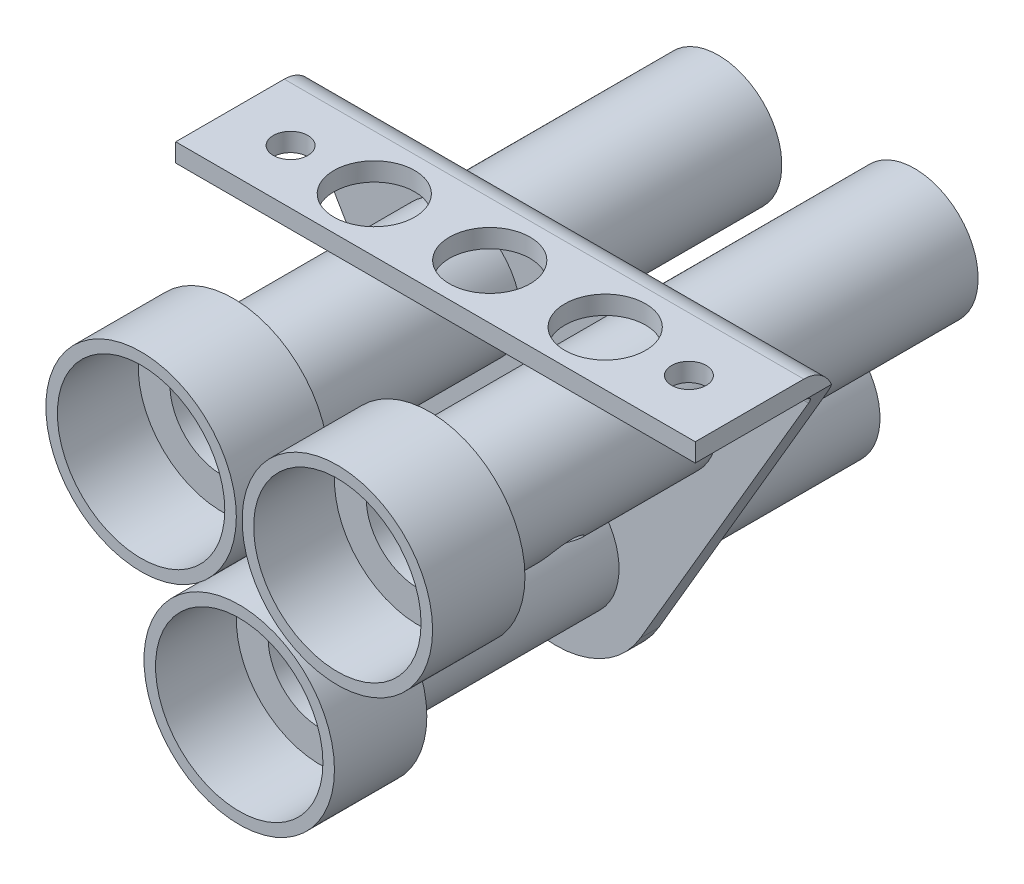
from build123d import *

# Parameters (mm, degrees)
ESQUISSE1_R             = 5.5
ESQUISSE1_R_2           = 4.5
BOSS_EXTRU_1_DEPTH      = 42
BOSS_EXTRU_1_2_DEPTH    = 42
BOSS_EXTRU_1_3_DEPTH    = 42
ESQUISSE2_R             = 8.25
ESQUISSE2_R_2           = 4.5
BOSS_EXTRU_2_DEPTH      = 1
ESQUISSE3_R             = 8.25
ESQUISSE3_R_2           = 7.25
BOSS_EXTRU_3_DEPTH      = 7
ESQUISSE4_R             = 2
ESQUISSE4_R_2           = 5.5
BOSS_EXTRU_4_DEPTH      = 1.6
ESQUISSE5_W             = 45
ESQUISSE5_H             = 12
BOSS_EXTRU_5_DEPTH      = 1.6
CONG_1_R                = 1
CONG_2_R                = 2.6
ENL_V_MAT_EXTRU_1_REACH = 65.345
ESQUISSE6_R             = 1.5
ESQUISSE6_R_2           = 3.5
ESQUISSE7_R             = 2
ENL_V_MAT_EXTRU_2_DEPTH = 63.612632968
ESQUISSE8_R             = 2
ENL_V_MAT_EXTRU_3_DEPTH = 63.612632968


with BuildPart() as part:
    # Esquisse1 → Boss.-Extru.1 (new body)
    with BuildSketch(Plane.XY):
        with Locations(Location((-8.5, -8.5, 0), (0, 0, 180))):
            Circle(ESQUISSE1_R)
        with Locations(Location((-8.5, -8.5, 0), (0, 0, 180))):
            Circle(ESQUISSE1_R_2, mode=Mode.SUBTRACT)
    extrude(amount=BOSS_EXTRU_1_DEPTH)



with BuildPart() as body_2:
    # Esquisse1 → Boss.-Extru.1 2 (new body)
    with BuildSketch(Plane.XY):
        with Locations(Location((8.5, -8.5, 0), (0, 0, 180))):
            Circle(ESQUISSE1_R)
        with Locations(Location((8.5, -8.5, 0), (0, 0, 180))):
            Circle(ESQUISSE1_R_2, mode=Mode.SUBTRACT)
    extrude(amount=BOSS_EXTRU_1_2_DEPTH)


with BuildPart() as body_3:
    # Esquisse1 → Boss.-Extru.1 3 (new body)
    with BuildSketch(Plane.XY):
        with Locations(Location((0, -23.222431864, 0), (0, 0, 180))):
            Circle(ESQUISSE1_R)
        with Locations(Location((0, -23.222431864, 0), (0, 0, 180))):
            Circle(ESQUISSE1_R_2, mode=Mode.SUBTRACT)
    extrude(amount=BOSS_EXTRU_1_3_DEPTH)


with BuildPart() as part_1:
    add(part.part)

    add(body_2.part)  # Boss.-Extru.2 merges body 2

    add(body_3.part)  # Boss.-Extru.2 merges body 3
    # Esquisse2 → Boss.-Extru.2 (add)
    # profile 1 of 3: a face of its own
    with BuildSketch(Plane.XY.offset(42)):
        with Locations((-8.5, -8.5)):
            Circle(ESQUISSE2_R)
        with Locations(Location((-8.5, -8.5, 0), (0, 0, 180))):
            Circle(ESQUISSE2_R_2, mode=Mode.SUBTRACT)
    # profile 2 of 3: a face of its own
    with BuildSketch(Plane.XY.offset(42)):
        with Locations((8.5, -8.5)):
            Circle(ESQUISSE2_R)
        with Locations(Location((8.5, -8.5, 0), (0, 0, 180))):
            Circle(ESQUISSE2_R_2, mode=Mode.SUBTRACT)
    # profile 3 of 3: a face of its own
    with BuildSketch(Plane.XY.offset(42)):
        with Locations((0, -23.222431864)):
            Circle(ESQUISSE2_R)
        with Locations(Location((0, -23.222431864, 0), (0, 0, 180))):
            Circle(ESQUISSE2_R_2, mode=Mode.SUBTRACT)
    extrude(amount=BOSS_EXTRU_2_DEPTH)

    # Esquisse3 → Boss.-Extru.3 (add)
    # profile 1 of 3: a face of its own
    with BuildSketch(Plane.XY.offset(43)):
        with Locations((-8.5, -8.5)):
            Circle(ESQUISSE3_R)
        with Locations((-8.5, -8.5)):
            Circle(ESQUISSE3_R_2, mode=Mode.SUBTRACT)
    # profile 2 of 3: a face of its own
    with BuildSketch(Plane.XY.offset(43)):
        with Locations((8.5, -8.5)):
            Circle(ESQUISSE3_R)
        with Locations((8.5, -8.5)):
            Circle(ESQUISSE3_R_2, mode=Mode.SUBTRACT)
    # profile 3 of 3: a face of its own
    with BuildSketch(Plane.XY.offset(43)):
        with Locations((0, -23.222431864)):
            Circle(ESQUISSE3_R)
        with Locations((0, -23.222431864)):
            Circle(ESQUISSE3_R_2, mode=Mode.SUBTRACT)
    extrude(amount=BOSS_EXTRU_3_DEPTH)

    # Esquisse4 → Boss.-Extru.4 (add)
    with BuildSketch(Plane(origin=(0, 0, 21), x_dir=(-1, 0, 0), z_dir=(0, 0, -1))):
        with BuildLine():
            Line((-22.5, 0), (22.5, 0))
            Line((22.5, 0), (22.5, -1.6))
            Line((22.5, -1.6), (7.336391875, -27.515141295))
            ThreePointArc((7.336391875, -27.515141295), (0, -31.722431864), (-7.336391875, -27.515141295))
            Line((-7.336391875, -27.515141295), (-22.5, -1.6))
            Line((-22.5, -1.6), (-22.5, 0))
        make_face()
        with Locations((0, -13.407477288)):
            Circle(ESQUISSE4_R, mode=Mode.SUBTRACT)
        with Locations((0, -23.222431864)):
            Circle(ESQUISSE4_R_2, mode=Mode.SUBTRACT)
        with Locations((8.5, -8.5)):
            Circle(ESQUISSE4_R_2, mode=Mode.SUBTRACT)
        with Locations((-8.5, -8.5)):
            Circle(ESQUISSE4_R_2, mode=Mode.SUBTRACT)
    extrude(amount=-BOSS_EXTRU_4_DEPTH)

    # Esquisse5 → Boss.-Extru.5 (add)
    with BuildSketch(Plane(origin=(0, 0, 0), x_dir=(1, 0, 0), z_dir=(0, 1, 0))):
        with Locations((0, -27)):
            Rectangle(ESQUISSE5_W, ESQUISSE5_H)
    extrude(amount=-BOSS_EXTRU_5_DEPTH)

    # Cong_1
    cong_1_edges = [part_1.edges().sort_by_distance(p)[0] for p in [
        (0, -1.6, 22.6),
    ]]
    fillet(cong_1_edges, radius=CONG_1_R)

    # Cong_2
    cong_2_edges = [part_1.edges().sort_by_distance(p)[0] for p in [
        (0, 0, 21),
    ]]
    fillet(cong_2_edges, radius=CONG_2_R)

    # Esquisse6 → Enl_v. mat.-Extru.1 (cut, up to next)
    with BuildSketch(Plane(origin=(0, 0, 0), x_dir=(1, 0, 0), z_dir=(0, 1, 0)), mode=Mode.PRIVATE) as enl_v_mat_extru_1_sk1:
        with Locations(Location((-17.25, -28.3, 0), (0, 0, 180))):
            Circle(ESQUISSE6_R)
    enl_v_mat_extru_1_tool1 = extrude(enl_v_mat_extru_1_sk1.sketch, amount=-ENL_V_MAT_EXTRU_1_REACH, mode=Mode.PRIVATE) & part_1.part
    # Esquisse6 → Enl_v. mat.-Extru.1 (cut, up to next)
    with BuildSketch(Plane(origin=(0, 0, 0), x_dir=(1, 0, 0), z_dir=(0, 1, 0)), mode=Mode.PRIVATE) as enl_v_mat_extru_1_sk2:
        with Locations(Location((17.25, -28.3, 0), (0, 0, 180))):
            Circle(ESQUISSE6_R)
    enl_v_mat_extru_1_tool2 = extrude(enl_v_mat_extru_1_sk2.sketch, amount=-ENL_V_MAT_EXTRU_1_REACH, mode=Mode.PRIVATE) & part_1.part
    # Esquisse6 → Enl_v. mat.-Extru.1 (cut, up to next)
    with BuildSketch(Plane(origin=(0, 0, 0), x_dir=(1, 0, 0), z_dir=(0, 1, 0)), mode=Mode.PRIVATE) as enl_v_mat_extru_1_sk3:
        with Locations(Location((10, -28.3, 0), (0, 0, 180))):
            Circle(ESQUISSE6_R_2)
    enl_v_mat_extru_1_tool3 = extrude(enl_v_mat_extru_1_sk3.sketch, amount=-ENL_V_MAT_EXTRU_1_REACH, mode=Mode.PRIVATE) & part_1.part
    # Esquisse6 → Enl_v. mat.-Extru.1 (cut, up to next)
    with BuildSketch(Plane(origin=(0, 0, 0), x_dir=(1, 0, 0), z_dir=(0, 1, 0)), mode=Mode.PRIVATE) as enl_v_mat_extru_1_sk4:
        with Locations(Location((0, -28.3, 0), (0, 0, 180))):
            Circle(ESQUISSE6_R_2)
    enl_v_mat_extru_1_tool4 = extrude(enl_v_mat_extru_1_sk4.sketch, amount=-ENL_V_MAT_EXTRU_1_REACH, mode=Mode.PRIVATE) & part_1.part
    # Esquisse6 → Enl_v. mat.-Extru.1 (cut, up to next)
    with BuildSketch(Plane(origin=(0, 0, 0), x_dir=(1, 0, 0), z_dir=(0, 1, 0)), mode=Mode.PRIVATE) as enl_v_mat_extru_1_sk5:
        with Locations(Location((-10, -28.3, 0), (0, 0, 180))):
            Circle(ESQUISSE6_R_2)
    enl_v_mat_extru_1_tool5 = extrude(enl_v_mat_extru_1_sk5.sketch, amount=-ENL_V_MAT_EXTRU_1_REACH, mode=Mode.PRIVATE) & part_1.part
    add(enl_v_mat_extru_1_tool1.solids().sort_by_distance((-17.25, 0, 28.3))[0], mode=Mode.SUBTRACT)
    add(enl_v_mat_extru_1_tool2.solids().sort_by_distance((17.25, 0, 28.3))[0], mode=Mode.SUBTRACT)
    add(enl_v_mat_extru_1_tool3.solids().sort_by_distance((10, 0, 28.3))[0], mode=Mode.SUBTRACT)
    add(enl_v_mat_extru_1_tool4.solids().sort_by_distance((0, 0, 28.3))[0], mode=Mode.SUBTRACT)
    add(enl_v_mat_extru_1_tool5.solids().sort_by_distance((-10, 0, 28.3))[0], mode=Mode.SUBTRACT)

    # Esquisse7 → Enl_v. mat.-Extru.2 (cut, through all)
    with BuildSketch(Plane(origin=(7.697428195, -9.173437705, 0), x_dir=(0.7660444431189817, 0.642787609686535, 0), z_dir=(0.642787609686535, -0.7660444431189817, 0))):
        with Locations(Location((1.047683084, 34.6, 0), (0, 0, 180))):
            Circle(ESQUISSE7_R)
    extrude(amount=ENL_V_MAT_EXTRU_2_DEPTH, mode=Mode.SUBTRACT)

    # Esquisse8 → Enl_v. mat.-Extru.3 (cut, through all)
    with BuildSketch(Plane(origin=(-7.697428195, -9.173437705, 0), x_dir=(-0.7660444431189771, 0.6427876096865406, 0), z_dir=(0.6427876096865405, 0.766044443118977, 0))):
        with Locations((1.047683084, 34.6)):
            Circle(ESQUISSE8_R)
    extrude(amount=-ENL_V_MAT_EXTRU_3_DEPTH, mode=Mode.SUBTRACT)


solid = part_1.part
